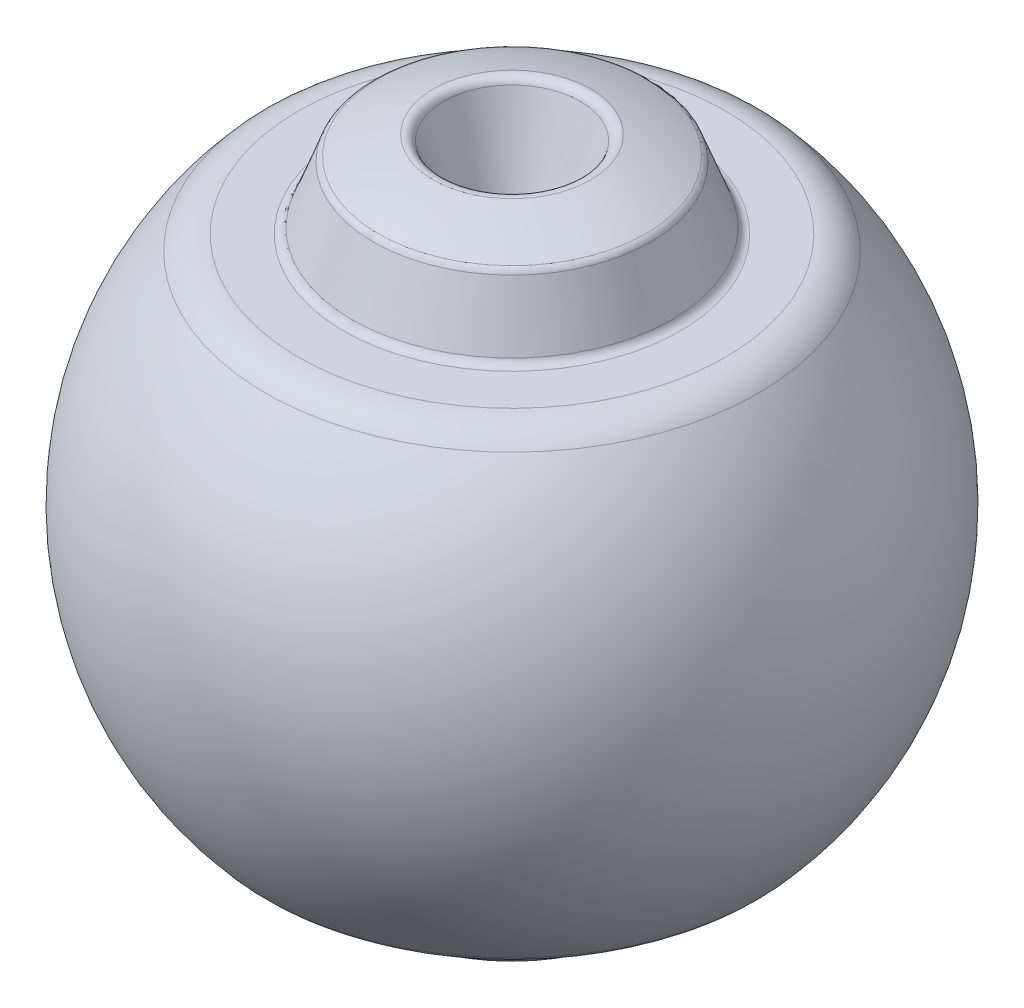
ISO-10303-21;
HEADER;
FILE_DESCRIPTION(('STEP AP214'),'2;1');
FILE_NAME('part.step','',(''),(''),'','','');
FILE_SCHEMA(('AUTOMOTIVE_DESIGN { 1 0 10303 214 1 1 1 1 }'));
ENDSEC;
DATA;
#1=APPLICATION_CONTEXT('core data for automotive mechanical design processes');
#2=APPLICATION_PROTOCOL_DEFINITION('international standard','automotive_design',2000,#1);
#3=PRODUCT_CONTEXT('',#1,'mechanical');
#4=PRODUCT('Part','Part','',(#3));
#5=PRODUCT_RELATED_PRODUCT_CATEGORY('part','',(#4));
#6=PRODUCT_DEFINITION_FORMATION('','',#4);
#7=PRODUCT_DEFINITION_CONTEXT('part definition',#1,'design');
#8=PRODUCT_DEFINITION('design','',#6,#7);
#9=PRODUCT_DEFINITION_SHAPE('','',#8);
#10=(LENGTH_UNIT() NAMED_UNIT(*) SI_UNIT(.MILLI.,.METRE.));
#11=(NAMED_UNIT(*) PLANE_ANGLE_UNIT() SI_UNIT($,.RADIAN.));
#12=(NAMED_UNIT(*) SI_UNIT($,.STERADIAN.) SOLID_ANGLE_UNIT());
#13=UNCERTAINTY_MEASURE_WITH_UNIT(LENGTH_MEASURE(1.E-05),#10,'distance_accuracy_value','');
#14=(GEOMETRIC_REPRESENTATION_CONTEXT(3) GLOBAL_UNCERTAINTY_ASSIGNED_CONTEXT((#13)) GLOBAL_UNIT_ASSIGNED_CONTEXT((#10,
#11,#12)) REPRESENTATION_CONTEXT('',''));
#15=CARTESIAN_POINT('',(0.,0.,0.));
#16=DIRECTION('',(0.,0.,1.));
#17=DIRECTION('',(1.,0.,0.));
#18=AXIS2_PLACEMENT_3D('',#15,#16,#17);
#19=CARTESIAN_POINT('',(0.,0.,0.));
#20=DIRECTION('',(0.,1.,0.));
#21=DIRECTION('',(1.,0.,0.));
#22=AXIS2_PLACEMENT_3D('',#19,#20,#21);
#23=SPHERICAL_SURFACE('',#22,37.5);
#24=CARTESIAN_POINT('',(0.,24.9165030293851,0.));
#25=DIRECTION('',(0.,-1.,0.));
#26=DIRECTION('',(1.,0.,0.));
#27=AXIS2_PLACEMENT_3D('',#24,#25,#26);
#28=CIRCLE('',#27,28.0253077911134);
#29=CARTESIAN_POINT('',(28.0253077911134,24.9165030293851,0.));
#30=VERTEX_POINT('',#29);
#31=EDGE_CURVE('E39',#30,#30,#28,.T.);
#32=CARTESIAN_POINT('',(0.,-24.9165030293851,0.));
#33=DIRECTION('',(0.,1.,0.));
#34=DIRECTION('',(-1.,0.,0.));
#35=AXIS2_PLACEMENT_3D('',#32,#33,#34);
#36=CIRCLE('',#35,28.0253077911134);
#37=CARTESIAN_POINT('',(28.0253077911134,-24.9165030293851,0.));
#38=VERTEX_POINT('',#37);
#39=EDGE_CURVE('E43',#38,#38,#36,.T.);
#40=CARTESIAN_POINT('',(28.0253077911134,24.9165030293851,0.));
#41=CARTESIAN_POINT('',(28.4025637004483,24.4921916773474,0.));
#42=CARTESIAN_POINT('',(28.7701685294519,24.0593008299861,0.));
#43=CARTESIAN_POINT('',(29.4853503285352,23.1772795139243,0.));
#44=CARTESIAN_POINT('',(29.8329272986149,22.7281490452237,0.));
#45=CARTESIAN_POINT('',(30.5073276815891,21.8145678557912,0.));
#46=CARTESIAN_POINT('',(30.8341510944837,21.3501171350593,0.));
#47=CARTESIAN_POINT('',(31.4663725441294,20.4068553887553,0.));
#48=CARTESIAN_POINT('',(31.7717705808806,19.9280443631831,0.));
#49=CARTESIAN_POINT('',(32.360510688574,18.9570491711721,0.));
#50=CARTESIAN_POINT('',(32.6438527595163,18.4648650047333,0.));
#51=CARTESIAN_POINT('',(33.1878966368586,17.4681389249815,0.));
#52=CARTESIAN_POINT('',(33.4485984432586,16.9635970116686,0.));
#53=CARTESIAN_POINT('',(33.9468239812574,15.9431961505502,0.));
#54=CARTESIAN_POINT('',(34.1843477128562,15.4273372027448,0.));
#55=CARTESIAN_POINT('',(34.6357271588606,14.3853663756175,0.));
#56=CARTESIAN_POINT('',(34.8495828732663,13.8592544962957,0.));
#57=CARTESIAN_POINT('',(35.2531851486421,12.7978630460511,0.));
#58=CARTESIAN_POINT('',(35.4429317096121,12.2625834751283,0.));
#59=CARTESIAN_POINT('',(35.797924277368,11.1839607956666,0.));
#60=CARTESIAN_POINT('',(35.9631702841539,10.6406176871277,0.));
#61=CARTESIAN_POINT('',(36.2688208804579,9.54698871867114,0.));
#62=CARTESIAN_POINT('',(36.4092254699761,8.99670285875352,0.));
#63=CARTESIAN_POINT('',(36.6649036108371,7.89032349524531,0.));
#64=CARTESIAN_POINT('',(36.7801771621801,7.33422999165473,0.));
#65=CARTESIAN_POINT('',(36.9853554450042,6.21738242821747,0.));
#66=CARTESIAN_POINT('',(37.0752601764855,5.65662836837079,0.));
#67=CARTESIAN_POINT('',(37.2295153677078,4.53161639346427,0.));
#68=CARTESIAN_POINT('',(37.2938658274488,3.96735847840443,0.));
#69=CARTESIAN_POINT('',(37.3968797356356,2.83650272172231,0.));
#70=CARTESIAN_POINT('',(37.4355431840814,2.26990488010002,0.));
#71=CARTESIAN_POINT('',(37.4871033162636,1.13553802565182,0.));
#72=CARTESIAN_POINT('',(37.5,0.567769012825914,0.));
#73=CARTESIAN_POINT('',(37.5,-0.567769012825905,0.));
#74=CARTESIAN_POINT('',(37.4871033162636,-1.13553802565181,0.));
#75=CARTESIAN_POINT('',(37.4355431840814,-2.26990488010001,0.));
#76=CARTESIAN_POINT('',(37.3968797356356,-2.8365027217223,0.));
#77=CARTESIAN_POINT('',(37.2938658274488,-3.96735847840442,0.));
#78=CARTESIAN_POINT('',(37.2295153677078,-4.53161639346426,0.));
#79=CARTESIAN_POINT('',(37.0752601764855,-5.65662836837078,0.));
#80=CARTESIAN_POINT('',(36.9853554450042,-6.21738242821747,0.));
#81=CARTESIAN_POINT('',(36.7801771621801,-7.33422999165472,0.));
#82=CARTESIAN_POINT('',(36.6649036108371,-7.8903234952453,0.));
#83=CARTESIAN_POINT('',(36.4092254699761,-8.99670285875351,0.));
#84=CARTESIAN_POINT('',(36.2688208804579,-9.54698871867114,0.));
#85=CARTESIAN_POINT('',(35.9631702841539,-10.6406176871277,0.));
#86=CARTESIAN_POINT('',(35.797924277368,-11.1839607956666,0.));
#87=CARTESIAN_POINT('',(35.4429317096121,-12.2625834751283,0.));
#88=CARTESIAN_POINT('',(35.2531851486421,-12.7978630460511,0.));
#89=CARTESIAN_POINT('',(34.8495828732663,-13.8592544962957,0.));
#90=CARTESIAN_POINT('',(34.6357271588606,-14.3853663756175,0.));
#91=CARTESIAN_POINT('',(34.1843477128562,-15.4273372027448,0.));
#92=CARTESIAN_POINT('',(33.9468239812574,-15.9431961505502,0.));
#93=CARTESIAN_POINT('',(33.4485984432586,-16.9635970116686,0.));
#94=CARTESIAN_POINT('',(33.1878966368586,-17.4681389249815,0.));
#95=CARTESIAN_POINT('',(32.6438527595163,-18.4648650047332,0.));
#96=CARTESIAN_POINT('',(32.3605106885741,-18.9570491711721,0.));
#97=CARTESIAN_POINT('',(31.7717705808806,-19.9280443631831,0.));
#98=CARTESIAN_POINT('',(31.4663725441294,-20.4068553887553,0.));
#99=CARTESIAN_POINT('',(30.8341510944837,-21.3501171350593,0.));
#100=CARTESIAN_POINT('',(30.5073276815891,-21.8145678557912,0.));
#101=CARTESIAN_POINT('',(29.8329272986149,-22.7281490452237,0.));
#102=CARTESIAN_POINT('',(29.4853503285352,-23.1772795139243,0.));
#103=CARTESIAN_POINT('',(28.7701685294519,-24.0593008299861,0.));
#104=CARTESIAN_POINT('',(28.4025637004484,-24.4921916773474,0.));
#105=CARTESIAN_POINT('',(28.0253077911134,-24.9165030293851,0.));
#106=B_SPLINE_CURVE_WITH_KNOTS('',3,(#40,#41,#42,#43,#44,#45,#46,#47,#48,#49,#50,#51,#52,#53,
#54,#55,#56,#57,#58,#59,#60,#61,#62,#63,#64,#65,#66,#67,#68,#69,#70,#71,#72,#73,#74,#75,#76,#77,
#78,#79,#80,#81,#82,#83,#84,#85,#86,#87,#88,#89,#90,#91,#92,#93,#94,#95,#96,#97,#98,#99,#100,
#101,#102,#103,#104,#105),.UNSPECIFIED.,.F.,.F.,(4,2,2,2,2,2,2,2,2,2,2,2,2,2,2,2,2,2,2,2,2,2,2,
2,2,2,2,2,2,2,2,2,4),(0.,1.7031606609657,3.40632132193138,5.10948198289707,6.81264264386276,
8.51580330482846,10.2189639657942,11.9221246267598,13.6252852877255,15.3284459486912,
17.0316066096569,18.7347672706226,20.4379279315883,22.141088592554,23.8442492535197,
25.5474099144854,27.2505705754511,28.9537312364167,30.6568918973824,32.3600525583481,
34.0632132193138,35.7663738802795,37.4695345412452,39.1726952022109,40.8758558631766,
42.5790165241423,44.2821771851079,45.9853378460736,47.6884985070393,49.391659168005,
51.0948198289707,52.7979804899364,54.5011411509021),.UNSPECIFIED.);
#107=EDGE_CURVE('BSEAM32',#30,#38,#106,.T.);
#108=ORIENTED_EDGE('',*,*,#31,.T.);
#109=ORIENTED_EDGE('',*,*,#39,.T.);
#110=ORIENTED_EDGE('',*,*,#107,.T.);
#111=ORIENTED_EDGE('',*,*,#107,.F.);
#112=EDGE_LOOP('',(#108,#110,#109,#111));
#113=FACE_BOUND('',#112,.T.);
#114=ADVANCED_FACE('F32',(#113),#23,.T.);
#115=CARTESIAN_POINT('',(0.,26.5943026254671,0.));
#116=DIRECTION('',(0.,1.,0.));
#117=DIRECTION('',(-1.,0.,0.));
#118=AXIS2_PLACEMENT_3D('',#115,#116,#117);
#119=PLANE('',#118);
#120=CARTESIAN_POINT('',(0.,26.5943026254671,0.));
#121=DIRECTION('',(0.,1.,0.));
#122=DIRECTION('',(-1.,0.,0.));
#123=AXIS2_PLACEMENT_3D('',#120,#121,#122);
#124=CIRCLE('',#123,24.2886000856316);
#125=CARTESIAN_POINT('',(-24.2886000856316,26.5943026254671,0.));
#126=VERTEX_POINT('',#125);
#127=EDGE_CURVE('E47',#126,#126,#124,.T.);
#128=ORIENTED_EDGE('',*,*,#127,.T.);
#129=EDGE_LOOP('',(#128));
#130=FACE_BOUND('',#129,.T.);
#131=CARTESIAN_POINT('',(0.,26.5943026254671,0.));
#132=DIRECTION('',(0.,1.,0.));
#133=DIRECTION('',(-1.,0.,0.));
#134=AXIS2_PLACEMENT_3D('',#131,#132,#133);
#135=CIRCLE('',#134,19.1318013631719);
#136=CARTESIAN_POINT('',(-19.1318013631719,26.5943026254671,0.));
#137=VERTEX_POINT('',#136);
#138=EDGE_CURVE('E85',#137,#137,#135,.F.);
#139=ORIENTED_EDGE('',*,*,#138,.T.);
#140=EDGE_LOOP('',(#139));
#141=FACE_BOUND('',#140,.T.);
#142=ADVANCED_FACE('F134',(#130,#141),#119,.T.);
#143=CARTESIAN_POINT('',(0.,34.0861642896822,0.));
#144=DIRECTION('',(0.,-1.,0.));
#145=DIRECTION('',(1.,0.,0.));
#146=AXIS2_PLACEMENT_3D('',#143,#144,#145);
#147=CONICAL_SURFACE('',#146,15.632766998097,0.358333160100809);
#148=CARTESIAN_POINT('',(0.,33.6968099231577,0.));
#149=DIRECTION('',(0.,1.,0.));
#150=DIRECTION('',(-1.,0.,0.));
#151=AXIS2_PLACEMENT_3D('',#148,#149,#150);
#152=CIRCLE('',#151,15.7785806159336);
#153=CARTESIAN_POINT('',(-15.7785806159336,33.6968099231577,0.));
#154=VERTEX_POINT('',#153);
#155=EDGE_CURVE('E88',#154,#154,#152,.F.);
#156=ORIENTED_EDGE('',*,*,#155,.T.);
#157=EDGE_LOOP('',(#156));
#158=FACE_BOUND('',#157,.T.);
#159=CARTESIAN_POINT('',(0.,27.2435888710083,0.));
#160=DIRECTION('',(0.,-1.,0.));
#161=DIRECTION('',(1.,0.,0.));
#162=AXIS2_PLACEMENT_3D('',#159,#160,#161);
#163=CIRCLE('',#162,18.195318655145);
#164=CARTESIAN_POINT('',(18.195318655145,27.2435888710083,0.));
#165=VERTEX_POINT('',#164);
#166=EDGE_CURVE('E91',#165,#165,#163,.F.);
#167=ORIENTED_EDGE('',*,*,#166,.T.);
#168=EDGE_LOOP('',(#167));
#169=FACE_BOUND('',#168,.T.);
#170=ADVANCED_FACE('F139',(#158,#169),#147,.T.);
#171=CARTESIAN_POINT('',(0.,0.,0.));
#172=DIRECTION('',(0.,1.,0.));
#173=DIRECTION('',(1.,0.,0.));
#174=AXIS2_PLACEMENT_3D('',#171,#172,#173);
#175=SPHERICAL_SURFACE('',#174,37.5);
#176=CARTESIAN_POINT('',(0.,34.2596878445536,0.));
#177=DIRECTION('',(0.,-1.,0.));
#178=DIRECTION('',(1.,0.,0.));
#179=AXIS2_PLACEMENT_3D('',#176,#177,#178);
#180=CIRCLE('',#179,15.2487307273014);
#181=CARTESIAN_POINT('',(15.2487307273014,34.2596878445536,0.));
#182=VERTEX_POINT('',#181);
#183=EDGE_CURVE('E94',#182,#182,#180,.F.);
#184=CARTESIAN_POINT('',(0.,36.4138074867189,0.));
#185=DIRECTION('',(0.,-1.,0.));
#186=DIRECTION('',(1.,0.,0.));
#187=AXIS2_PLACEMENT_3D('',#184,#185,#186);
#188=CIRCLE('',#187,8.96016876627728);
#189=CARTESIAN_POINT('',(8.96016876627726,36.413807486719,0.));
#190=VERTEX_POINT('',#189);
#191=EDGE_CURVE('E97',#190,#190,#188,.T.);
#192=CARTESIAN_POINT('',(15.2487307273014,34.2596878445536,0.));
#193=CARTESIAN_POINT('',(15.1853883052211,34.2878810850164,0.));
#194=CARTESIAN_POINT('',(15.1219676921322,34.3158986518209,0.));
#195=CARTESIAN_POINT('',(14.994972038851,34.3715815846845,0.));
#196=CARTESIAN_POINT('',(14.9313969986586,34.3992469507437,0.));
#197=CARTESIAN_POINT('',(14.804094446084,34.4542246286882,0.));
#198=CARTESIAN_POINT('',(14.7403669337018,34.4815369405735,0.));
#199=CARTESIAN_POINT('',(14.6127613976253,34.5358076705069,0.));
#200=CARTESIAN_POINT('',(14.548883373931,34.5627660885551,0.));
#201=CARTESIAN_POINT('',(14.4209787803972,34.6163282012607,0.));
#202=CARTESIAN_POINT('',(14.3569522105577,34.6429318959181,0.));
#203=CARTESIAN_POINT('',(14.2287524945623,34.6957837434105,0.));
#204=CARTESIAN_POINT('',(14.1645793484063,34.7220318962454,0.));
#205=CARTESIAN_POINT('',(14.0360884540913,34.7741718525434,0.));
#206=CARTESIAN_POINT('',(13.9717707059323,34.8000636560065,0.));
#207=CARTESIAN_POINT('',(13.8429925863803,34.8514901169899,0.));
#208=CARTESIAN_POINT('',(13.7785322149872,34.8770247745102,0.));
#209=CARTESIAN_POINT('',(13.6494708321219,34.9277361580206,0.));
#210=CARTESIAN_POINT('',(13.5848698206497,34.9529128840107,0.));
#211=CARTESIAN_POINT('',(13.4555291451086,35.0029076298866,0.));
#212=CARTESIAN_POINT('',(13.3907894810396,35.0277256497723,0.));
#213=CARTESIAN_POINT('',(13.2611734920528,35.0770022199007,0.));
#214=CARTESIAN_POINT('',(13.196297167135,35.1014607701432,0.));
#215=CARTESIAN_POINT('',(13.0664098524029,35.1500176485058,0.));
#216=CARTESIAN_POINT('',(13.0013988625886,35.1741159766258,0.));
#217=CARTESIAN_POINT('',(12.871244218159,35.2219516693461,0.));
#218=CARTESIAN_POINT('',(12.8061005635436,35.2456890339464,0.));
#219=CARTESIAN_POINT('',(12.6756825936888,35.2928020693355,0.));
#220=CARTESIAN_POINT('',(12.6104082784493,35.3161777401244,0.));
#221=CARTESIAN_POINT('',(12.479730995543,35.3625666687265,0.));
#222=CARTESIAN_POINT('',(12.4143280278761,35.3855799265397,0.));
#223=CARTESIAN_POINT('',(12.2833954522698,35.4312433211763,0.));
#224=CARTESIAN_POINT('',(12.2178658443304,35.4538934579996,0.));
#225=CARTESIAN_POINT('',(12.0866820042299,35.4988299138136,0.));
#226=CARTESIAN_POINT('',(12.0210277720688,35.5211162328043,0.));
#227=CARTESIAN_POINT('',(11.8895967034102,35.5653243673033,0.));
#228=CARTESIAN_POINT('',(11.8238198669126,35.5872461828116,0.));
#229=CARTESIAN_POINT('',(11.692145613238,35.6307246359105,0.));
#230=CARTESIAN_POINT('',(11.626248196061,35.652281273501,0.));
#231=CARTESIAN_POINT('',(11.4943348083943,35.6950287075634,0.));
#232=CARTESIAN_POINT('',(11.4283188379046,35.7162195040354,0.));
#233=CARTESIAN_POINT('',(11.2961703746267,35.7582346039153,0.));
#234=CARTESIAN_POINT('',(11.2300378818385,35.7790589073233,0.));
#235=CARTESIAN_POINT('',(11.0976584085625,35.8203403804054,0.));
#236=CARTESIAN_POINT('',(11.0314114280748,35.8407975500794,0.));
#237=CARTESIAN_POINT('',(10.8988050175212,35.8813441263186,0.));
#238=CARTESIAN_POINT('',(10.8324455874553,35.9014335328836,0.));
#239=CARTESIAN_POINT('',(10.6996163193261,35.9412439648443,0.));
#240=CARTESIAN_POINT('',(10.6331464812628,35.9609649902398,0.));
#241=CARTESIAN_POINT('',(10.5000984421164,36.0000380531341,0.));
#242=CARTESIAN_POINT('',(10.4335202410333,36.0193900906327,0.));
#243=CARTESIAN_POINT('',(10.300257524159,36.0577245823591,0.));
#244=CARTESIAN_POINT('',(10.2335730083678,36.0767070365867,0.));
#245=CARTESIAN_POINT('',(10.1000997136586,36.114301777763,0.));
#246=CARTESIAN_POINT('',(10.0333109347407,36.1329140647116,0.));
#247=CARTESIAN_POINT('',(9.89963116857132,36.169767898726,0.));
#248=CARTESIAN_POINT('',(9.83274018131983,36.1880094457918,0.));
#249=CARTESIAN_POINT('',(9.69885805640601,36.2241212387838,0.));
#250=CARTESIAN_POINT('',(9.63186691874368,36.2419914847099,0.));
#251=CARTESIAN_POINT('',(9.49778655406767,36.2773601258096,0.));
#252=CARTESIAN_POINT('',(9.43069732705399,36.2948585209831,0.));
#253=CARTESIAN_POINT('',(9.29642284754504,36.329482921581,0.));
#254=CARTESIAN_POINT('',(9.22923759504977,36.3466089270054,0.));
#255=CARTESIAN_POINT('',(9.09477313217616,36.3804880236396,0.));
#256=CARTESIAN_POINT('',(9.02749392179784,36.3972411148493,0.));
#257=CARTESIAN_POINT('',(8.96016876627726,36.413807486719,0.));
#258=B_SPLINE_CURVE_WITH_KNOTS('',3,(#192,#193,#194,#195,#196,#197,#198,#199,#200,#201,#202,
#203,#204,#205,#206,#207,#208,#209,#210,#211,#212,#213,#214,#215,#216,#217,#218,#219,#220,#221,
#222,#223,#224,#225,#226,#227,#228,#229,#230,#231,#232,#233,#234,#235,#236,#237,#238,#239,#240,
#241,#242,#243,#244,#245,#246,#247,#248,#249,#250,#251,#252,#253,#254,#255,#256,#257),
.UNSPECIFIED.,.F.,.F.,(4,2,2,2,2,2,2,2,2,2,2,2,2,2,2,2,2,2,2,2,2,2,2,2,2,2,2,2,2,2,2,2,4),(0.,
0.20799995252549,0.415999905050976,0.623999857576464,0.831999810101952,1.03999976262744,
1.24799971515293,1.45599966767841,1.66399962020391,1.8719995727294,2.07999952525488,
2.28799947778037,2.49599943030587,2.70399938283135,2.91199933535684,3.11999928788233,
3.32799924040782,3.53599919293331,3.74399914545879,3.95199909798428,4.15999905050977,
4.36799900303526,4.57599895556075,4.78399890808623,4.99199886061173,5.19999881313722,
5.4079987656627,5.61599871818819,5.82399867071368,6.03199862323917,6.23999857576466,
6.44799852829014,6.65599848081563),.UNSPECIFIED.);
#259=EDGE_CURVE('BSEAM101',#182,#190,#258,.T.);
#260=ORIENTED_EDGE('',*,*,#183,.T.);
#261=ORIENTED_EDGE('',*,*,#191,.T.);
#262=ORIENTED_EDGE('',*,*,#259,.T.);
#263=ORIENTED_EDGE('',*,*,#259,.F.);
#264=EDGE_LOOP('',(#260,#262,#261,#263));
#265=FACE_BOUND('',#264,.T.);
#266=ADVANCED_FACE('F101',(#265),#175,.T.);
#267=CARTESIAN_POINT('',(0.,36.6181019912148,0.));
#268=DIRECTION('',(0.,1.,0.));
#269=DIRECTION('',(-1.,0.,0.));
#270=AXIS2_PLACEMENT_3D('',#267,#268,#269);
#271=CONICAL_SURFACE('',#270,8.08483806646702,0.349065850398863);
#272=CARTESIAN_POINT('',(0.,35.7847927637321,0.));
#273=DIRECTION('',(0.,1.,0.));
#274=DIRECTION('',(-1.,0.,0.));
#275=AXIS2_PLACEMENT_3D('',#272,#273,#274);
#276=CIRCLE('',#275,7.78153831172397);
#277=CARTESIAN_POINT('',(-7.78153831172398,35.7847927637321,0.));
#278=VERTEX_POINT('',#277);
#279=EDGE_CURVE('E79',#278,#278,#276,.T.);
#280=ORIENTED_EDGE('',*,*,#279,.T.);
#281=EDGE_LOOP('',(#280));
#282=FACE_BOUND('',#281,.T.);
#283=CARTESIAN_POINT('',(0.,27.2522824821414,0.));
#284=DIRECTION('',(0.,1.,0.));
#285=DIRECTION('',(-1.,0.,0.));
#286=AXIS2_PLACEMENT_3D('',#283,#284,#285);
#287=CIRCLE('',#286,4.67595854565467);
#288=CARTESIAN_POINT('',(-4.67595854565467,27.2522824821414,0.));
#289=VERTEX_POINT('',#288);
#290=EDGE_CURVE('E82',#289,#289,#287,.F.);
#291=ORIENTED_EDGE('',*,*,#290,.T.);
#292=EDGE_LOOP('',(#291));
#293=FACE_BOUND('',#292,.T.);
#294=ADVANCED_FACE('F111',(#282,#293),#271,.F.);
#295=CARTESIAN_POINT('',(0.,26.5943026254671,0.));
#296=DIRECTION('',(0.,-1.,0.));
#297=DIRECTION('',(1.,0.,0.));
#298=AXIS2_PLACEMENT_3D('',#295,#296,#297);
#299=PLANE('',#298);
#300=CARTESIAN_POINT('',(0.,26.5943026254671,0.));
#301=DIRECTION('',(0.,-1.,0.));
#302=DIRECTION('',(1.,0.,0.));
#303=AXIS2_PLACEMENT_3D('',#300,#301,#302);
#304=CIRCLE('',#303,3.73626592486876);
#305=CARTESIAN_POINT('',(3.73626592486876,26.5943026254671,0.));
#306=VERTEX_POINT('',#305);
#307=EDGE_CURVE('E76',#306,#306,#304,.F.);
#308=ORIENTED_EDGE('',*,*,#307,.T.);
#309=EDGE_LOOP('',(#308));
#310=FACE_BOUND('',#309,.T.);
#311=ADVANCED_FACE('F114',(#310),#299,.F.);
#312=CARTESIAN_POINT('',(0.,-26.5943026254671,0.));
#313=DIRECTION('',(0.,-1.,0.));
#314=DIRECTION('',(1.,0.,0.));
#315=AXIS2_PLACEMENT_3D('',#312,#313,#314);
#316=PLANE('',#315);
#317=CARTESIAN_POINT('',(0.,-26.5943026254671,0.));
#318=DIRECTION('',(0.,-1.,0.));
#319=DIRECTION('',(1.,0.,0.));
#320=AXIS2_PLACEMENT_3D('',#317,#318,#319);
#321=CIRCLE('',#320,3.73626592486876);
#322=CARTESIAN_POINT('',(3.73626592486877,-26.5943026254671,0.));
#323=VERTEX_POINT('',#322);
#324=EDGE_CURVE('E52',#323,#323,#321,.T.);
#325=ORIENTED_EDGE('',*,*,#324,.T.);
#326=EDGE_LOOP('',(#325));
#327=FACE_BOUND('',#326,.T.);
#328=ADVANCED_FACE('F125',(#327),#316,.T.);
#329=CARTESIAN_POINT('',(0.,-36.6181019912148,0.));
#330=DIRECTION('',(0.,-1.,0.));
#331=DIRECTION('',(1.,0.,0.));
#332=AXIS2_PLACEMENT_3D('',#329,#330,#331);
#333=CONICAL_SURFACE('',#332,8.08483806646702,0.349065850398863);
#334=CARTESIAN_POINT('',(0.,-35.7847927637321,0.));
#335=DIRECTION('',(0.,1.,0.));
#336=DIRECTION('',(-1.,0.,0.));
#337=AXIS2_PLACEMENT_3D('',#334,#335,#336);
#338=CIRCLE('',#337,7.78153831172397);
#339=CARTESIAN_POINT('',(-7.78153831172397,-35.7847927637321,0.));
#340=VERTEX_POINT('',#339);
#341=EDGE_CURVE('E55',#340,#340,#338,.F.);
#342=ORIENTED_EDGE('',*,*,#341,.T.);
#343=EDGE_LOOP('',(#342));
#344=FACE_BOUND('',#343,.T.);
#345=CARTESIAN_POINT('',(0.,-27.2522824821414,0.));
#346=DIRECTION('',(0.,-1.,0.));
#347=DIRECTION('',(1.,0.,0.));
#348=AXIS2_PLACEMENT_3D('',#345,#346,#347);
#349=CIRCLE('',#348,4.67595854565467);
#350=CARTESIAN_POINT('',(4.67595854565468,-27.2522824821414,0.));
#351=VERTEX_POINT('',#350);
#352=EDGE_CURVE('E58',#351,#351,#349,.F.);
#353=ORIENTED_EDGE('',*,*,#352,.T.);
#354=EDGE_LOOP('',(#353));
#355=FACE_BOUND('',#354,.T.);
#356=ADVANCED_FACE('F130',(#344,#355),#333,.F.);
#357=CARTESIAN_POINT('',(0.,0.,0.));
#358=DIRECTION('',(0.,1.,0.));
#359=DIRECTION('',(1.,0.,0.));
#360=AXIS2_PLACEMENT_3D('',#357,#358,#359);
#361=SPHERICAL_SURFACE('',#360,37.5);
#362=CARTESIAN_POINT('',(0.,-34.2596878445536,0.));
#363=DIRECTION('',(0.,1.,0.));
#364=DIRECTION('',(-1.,0.,0.));
#365=AXIS2_PLACEMENT_3D('',#362,#363,#364);
#366=CIRCLE('',#365,15.2487307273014);
#367=CARTESIAN_POINT('',(15.2487307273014,-34.2596878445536,0.));
#368=VERTEX_POINT('',#367);
#369=EDGE_CURVE('E64',#368,#368,#366,.F.);
#370=CARTESIAN_POINT('',(0.,-36.413807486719,0.));
#371=DIRECTION('',(0.,1.,0.));
#372=DIRECTION('',(-1.,0.,0.));
#373=AXIS2_PLACEMENT_3D('',#370,#371,#372);
#374=CIRCLE('',#373,8.96016876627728);
#375=CARTESIAN_POINT('',(8.96016876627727,-36.413807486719,0.));
#376=VERTEX_POINT('',#375);
#377=EDGE_CURVE('E67',#376,#376,#374,.T.);
#378=CARTESIAN_POINT('',(15.2487307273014,-34.2596878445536,0.));
#379=CARTESIAN_POINT('',(15.1853883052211,-34.2878810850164,0.));
#380=CARTESIAN_POINT('',(15.1219676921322,-34.3158986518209,0.));
#381=CARTESIAN_POINT('',(14.994972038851,-34.3715815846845,0.));
#382=CARTESIAN_POINT('',(14.9313969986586,-34.3992469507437,0.));
#383=CARTESIAN_POINT('',(14.804094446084,-34.4542246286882,0.));
#384=CARTESIAN_POINT('',(14.7403669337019,-34.4815369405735,0.));
#385=CARTESIAN_POINT('',(14.6127613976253,-34.535807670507,0.));
#386=CARTESIAN_POINT('',(14.548883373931,-34.5627660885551,0.));
#387=CARTESIAN_POINT('',(14.4209787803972,-34.6163282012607,0.));
#388=CARTESIAN_POINT('',(14.3569522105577,-34.6429318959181,0.));
#389=CARTESIAN_POINT('',(14.2287524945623,-34.6957837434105,0.));
#390=CARTESIAN_POINT('',(14.1645793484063,-34.7220318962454,0.));
#391=CARTESIAN_POINT('',(14.0360884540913,-34.7741718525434,0.));
#392=CARTESIAN_POINT('',(13.9717707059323,-34.8000636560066,0.));
#393=CARTESIAN_POINT('',(13.8429925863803,-34.8514901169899,0.));
#394=CARTESIAN_POINT('',(13.7785322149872,-34.8770247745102,0.));
#395=CARTESIAN_POINT('',(13.6494708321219,-34.9277361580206,0.));
#396=CARTESIAN_POINT('',(13.5848698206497,-34.9529128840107,0.));
#397=CARTESIAN_POINT('',(13.4555291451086,-35.0029076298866,0.));
#398=CARTESIAN_POINT('',(13.3907894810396,-35.0277256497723,0.));
#399=CARTESIAN_POINT('',(13.2611734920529,-35.0770022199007,0.));
#400=CARTESIAN_POINT('',(13.196297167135,-35.1014607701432,0.));
#401=CARTESIAN_POINT('',(13.0664098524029,-35.1500176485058,0.));
#402=CARTESIAN_POINT('',(13.0013988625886,-35.1741159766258,0.));
#403=CARTESIAN_POINT('',(12.871244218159,-35.2219516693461,0.));
#404=CARTESIAN_POINT('',(12.8061005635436,-35.2456890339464,0.));
#405=CARTESIAN_POINT('',(12.6756825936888,-35.2928020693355,0.));
#406=CARTESIAN_POINT('',(12.6104082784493,-35.3161777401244,0.));
#407=CARTESIAN_POINT('',(12.479730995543,-35.3625666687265,0.));
#408=CARTESIAN_POINT('',(12.4143280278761,-35.3855799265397,0.));
#409=CARTESIAN_POINT('',(12.2833954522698,-35.4312433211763,0.));
#410=CARTESIAN_POINT('',(12.2178658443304,-35.4538934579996,0.));
#411=CARTESIAN_POINT('',(12.0866820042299,-35.4988299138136,0.));
#412=CARTESIAN_POINT('',(12.0210277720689,-35.5211162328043,0.));
#413=CARTESIAN_POINT('',(11.8895967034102,-35.5653243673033,0.));
#414=CARTESIAN_POINT('',(11.8238198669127,-35.5872461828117,0.));
#415=CARTESIAN_POINT('',(11.692145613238,-35.6307246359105,0.));
#416=CARTESIAN_POINT('',(11.626248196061,-35.652281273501,0.));
#417=CARTESIAN_POINT('',(11.4943348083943,-35.6950287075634,0.));
#418=CARTESIAN_POINT('',(11.4283188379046,-35.7162195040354,0.));
#419=CARTESIAN_POINT('',(11.2961703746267,-35.7582346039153,0.));
#420=CARTESIAN_POINT('',(11.2300378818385,-35.7790589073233,0.));
#421=CARTESIAN_POINT('',(11.0976584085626,-35.8203403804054,0.));
#422=CARTESIAN_POINT('',(11.0314114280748,-35.8407975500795,0.));
#423=CARTESIAN_POINT('',(10.8988050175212,-35.8813441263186,0.));
#424=CARTESIAN_POINT('',(10.8324455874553,-35.9014335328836,0.));
#425=CARTESIAN_POINT('',(10.6996163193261,-35.9412439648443,0.));
#426=CARTESIAN_POINT('',(10.6331464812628,-35.9609649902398,0.));
#427=CARTESIAN_POINT('',(10.5000984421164,-36.0000380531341,0.));
#428=CARTESIAN_POINT('',(10.4335202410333,-36.0193900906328,0.));
#429=CARTESIAN_POINT('',(10.300257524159,-36.0577245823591,0.));
#430=CARTESIAN_POINT('',(10.2335730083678,-36.0767070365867,0.));
#431=CARTESIAN_POINT('',(10.1000997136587,-36.114301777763,0.));
#432=CARTESIAN_POINT('',(10.0333109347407,-36.1329140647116,0.));
#433=CARTESIAN_POINT('',(9.89963116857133,-36.169767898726,0.));
#434=CARTESIAN_POINT('',(9.83274018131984,-36.1880094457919,0.));
#435=CARTESIAN_POINT('',(9.69885805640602,-36.2241212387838,0.));
#436=CARTESIAN_POINT('',(9.63186691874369,-36.2419914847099,0.));
#437=CARTESIAN_POINT('',(9.49778655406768,-36.2773601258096,0.));
#438=CARTESIAN_POINT('',(9.430697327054,-36.2948585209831,0.));
#439=CARTESIAN_POINT('',(9.29642284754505,-36.329482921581,0.));
#440=CARTESIAN_POINT('',(9.22923759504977,-36.3466089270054,0.));
#441=CARTESIAN_POINT('',(9.09477313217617,-36.3804880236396,0.));
#442=CARTESIAN_POINT('',(9.02749392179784,-36.3972411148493,0.));
#443=CARTESIAN_POINT('',(8.96016876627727,-36.413807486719,0.));
#444=B_SPLINE_CURVE_WITH_KNOTS('',3,(#378,#379,#380,#381,#382,#383,#384,#385,#386,#387,#388,
#389,#390,#391,#392,#393,#394,#395,#396,#397,#398,#399,#400,#401,#402,#403,#404,#405,#406,#407,
#408,#409,#410,#411,#412,#413,#414,#415,#416,#417,#418,#419,#420,#421,#422,#423,#424,#425,#426,
#427,#428,#429,#430,#431,#432,#433,#434,#435,#436,#437,#438,#439,#440,#441,#442,#443),
.UNSPECIFIED.,.F.,.F.,(4,2,2,2,2,2,2,2,2,2,2,2,2,2,2,2,2,2,2,2,2,2,2,2,2,2,2,2,2,2,2,2,4),(0.,
0.20799995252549,0.415999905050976,0.623999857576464,0.83199981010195,1.03999976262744,
1.24799971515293,1.45599966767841,1.66399962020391,1.8719995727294,2.07999952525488,
2.28799947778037,2.49599943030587,2.70399938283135,2.91199933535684,3.11999928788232,
3.32799924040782,3.53599919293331,3.74399914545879,3.95199909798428,4.15999905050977,
4.36799900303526,4.57599895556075,4.78399890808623,4.99199886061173,5.19999881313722,
5.4079987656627,5.61599871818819,5.82399867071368,6.03199862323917,6.23999857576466,
6.44799852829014,6.65599848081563),.UNSPECIFIED.);
#445=EDGE_CURVE('BSEAM216',#368,#376,#444,.T.);
#446=ORIENTED_EDGE('',*,*,#369,.T.);
#447=ORIENTED_EDGE('',*,*,#377,.T.);
#448=ORIENTED_EDGE('',*,*,#445,.T.);
#449=ORIENTED_EDGE('',*,*,#445,.F.);
#450=EDGE_LOOP('',(#446,#448,#447,#449));
#451=FACE_BOUND('',#450,.T.);
#452=ADVANCED_FACE('F216',(#451),#361,.T.);
#453=CARTESIAN_POINT('',(0.,-34.0861642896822,0.));
#454=DIRECTION('',(0.,1.,0.));
#455=DIRECTION('',(-1.,0.,0.));
#456=AXIS2_PLACEMENT_3D('',#453,#454,#455);
#457=CONICAL_SURFACE('',#456,15.632766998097,0.358333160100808);
#458=CARTESIAN_POINT('',(0.,-33.6968099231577,0.));
#459=DIRECTION('',(0.,1.,0.));
#460=DIRECTION('',(-1.,0.,0.));
#461=AXIS2_PLACEMENT_3D('',#458,#459,#460);
#462=CIRCLE('',#461,15.7785806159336);
#463=CARTESIAN_POINT('',(-15.7785806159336,-33.6968099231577,0.));
#464=VERTEX_POINT('',#463);
#465=EDGE_CURVE('E70',#464,#464,#462,.T.);
#466=ORIENTED_EDGE('',*,*,#465,.T.);
#467=EDGE_LOOP('',(#466));
#468=FACE_BOUND('',#467,.T.);
#469=CARTESIAN_POINT('',(0.,-27.2435888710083,0.));
#470=DIRECTION('',(0.,1.,0.));
#471=DIRECTION('',(-1.,0.,0.));
#472=AXIS2_PLACEMENT_3D('',#469,#470,#471);
#473=CIRCLE('',#472,18.195318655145);
#474=CARTESIAN_POINT('',(-18.1953186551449,-27.2435888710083,0.));
#475=VERTEX_POINT('',#474);
#476=EDGE_CURVE('E73',#475,#475,#473,.F.);
#477=ORIENTED_EDGE('',*,*,#476,.T.);
#478=EDGE_LOOP('',(#477));
#479=FACE_BOUND('',#478,.T.);
#480=ADVANCED_FACE('F226',(#468,#479),#457,.T.);
#481=CARTESIAN_POINT('',(0.,-26.5943026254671,0.));
#482=DIRECTION('',(0.,1.,0.));
#483=DIRECTION('',(-1.,0.,0.));
#484=AXIS2_PLACEMENT_3D('',#481,#482,#483);
#485=PLANE('',#484);
#486=CARTESIAN_POINT('',(0.,-26.5943026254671,0.));
#487=DIRECTION('',(0.,1.,0.));
#488=DIRECTION('',(-1.,0.,0.));
#489=AXIS2_PLACEMENT_3D('',#486,#487,#488);
#490=CIRCLE('',#489,24.2886000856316);
#491=CARTESIAN_POINT('',(-24.2886000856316,-26.5943026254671,0.));
#492=VERTEX_POINT('',#491);
#493=EDGE_CURVE('E10',#492,#492,#490,.F.);
#494=ORIENTED_EDGE('',*,*,#493,.T.);
#495=EDGE_LOOP('',(#494));
#496=FACE_BOUND('',#495,.T.);
#497=CARTESIAN_POINT('',(0.,-26.5943026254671,0.));
#498=DIRECTION('',(0.,1.,0.));
#499=DIRECTION('',(-1.,0.,0.));
#500=AXIS2_PLACEMENT_3D('',#497,#498,#499);
#501=CIRCLE('',#500,19.1318013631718);
#502=CARTESIAN_POINT('',(-19.1318013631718,-26.5943026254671,0.));
#503=VERTEX_POINT('',#502);
#504=EDGE_CURVE('E61',#503,#503,#501,.T.);
#505=ORIENTED_EDGE('',*,*,#504,.T.);
#506=EDGE_LOOP('',(#505));
#507=FACE_BOUND('',#506,.T.);
#508=ADVANCED_FACE('F148',(#496,#507),#485,.F.);
#509=CARTESIAN_POINT('',(0.,33.3460961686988,0.));
#510=DIRECTION('',(0.,-1.,0.));
#511=DIRECTION('',(1.,0.,0.));
#512=AXIS2_PLACEMENT_3D('',#509,#510,#511);
#513=TOROIDAL_SURFACE('',#512,14.8420979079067,1.);
#514=ORIENTED_EDGE('',*,*,#155,.F.);
#515=EDGE_LOOP('',(#514));
#516=FACE_BOUND('',#515,.T.);
#517=ORIENTED_EDGE('',*,*,#183,.F.);
#518=EDGE_LOOP('',(#517));
#519=FACE_BOUND('',#518,.T.);
#520=ADVANCED_FACE('F145',(#516,#519),#513,.T.);
#521=CARTESIAN_POINT('',(0.,27.5943026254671,0.));
#522=DIRECTION('',(0.,1.,0.));
#523=DIRECTION('',(-1.,0.,0.));
#524=AXIS2_PLACEMENT_3D('',#521,#522,#523);
#525=TOROIDAL_SURFACE('',#524,19.1318013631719,1.);
#526=ORIENTED_EDGE('',*,*,#138,.F.);
#527=EDGE_LOOP('',(#526));
#528=FACE_BOUND('',#527,.T.);
#529=ORIENTED_EDGE('',*,*,#166,.F.);
#530=EDGE_LOOP('',(#529));
#531=FACE_BOUND('',#530,.T.);
#532=ADVANCED_FACE('F107',(#528,#531),#525,.F.);
#533=CARTESIAN_POINT('',(0.,35.4427726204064,0.));
#534=DIRECTION('',(0.,-1.,0.));
#535=DIRECTION('',(1.,0.,0.));
#536=AXIS2_PLACEMENT_3D('',#533,#534,#535);
#537=TOROIDAL_SURFACE('',#536,8.72123093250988,1.);
#538=ORIENTED_EDGE('',*,*,#191,.F.);
#539=EDGE_LOOP('',(#538));
#540=FACE_BOUND('',#539,.T.);
#541=ORIENTED_EDGE('',*,*,#279,.F.);
#542=EDGE_LOOP('',(#541));
#543=FACE_BOUND('',#542,.T.);
#544=ADVANCED_FACE('F103',(#540,#543),#537,.T.);
#545=CARTESIAN_POINT('',(0.,27.5943026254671,0.));
#546=DIRECTION('',(0.,-1.,0.));
#547=DIRECTION('',(1.,0.,0.));
#548=AXIS2_PLACEMENT_3D('',#545,#546,#547);
#549=TOROIDAL_SURFACE('',#548,3.73626592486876,1.);
#550=ORIENTED_EDGE('',*,*,#290,.F.);
#551=EDGE_LOOP('',(#550));
#552=FACE_BOUND('',#551,.T.);
#553=ORIENTED_EDGE('',*,*,#307,.F.);
#554=EDGE_LOOP('',(#553));
#555=FACE_BOUND('',#554,.T.);
#556=ADVANCED_FACE('F106',(#552,#555),#549,.F.);
#557=CARTESIAN_POINT('',(0.,-33.3460961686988,0.));
#558=DIRECTION('',(0.,1.,0.));
#559=DIRECTION('',(-1.,0.,0.));
#560=AXIS2_PLACEMENT_3D('',#557,#558,#559);
#561=TOROIDAL_SURFACE('',#560,14.8420979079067,1.);
#562=ORIENTED_EDGE('',*,*,#369,.F.);
#563=EDGE_LOOP('',(#562));
#564=FACE_BOUND('',#563,.T.);
#565=ORIENTED_EDGE('',*,*,#465,.F.);
#566=EDGE_LOOP('',(#565));
#567=FACE_BOUND('',#566,.T.);
#568=ADVANCED_FACE('F120',(#564,#567),#561,.T.);
#569=CARTESIAN_POINT('',(0.,-27.5943026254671,0.));
#570=DIRECTION('',(0.,1.,0.));
#571=DIRECTION('',(-1.,0.,0.));
#572=AXIS2_PLACEMENT_3D('',#569,#570,#571);
#573=TOROIDAL_SURFACE('',#572,19.1318013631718,1.);
#574=ORIENTED_EDGE('',*,*,#476,.F.);
#575=EDGE_LOOP('',(#574));
#576=FACE_BOUND('',#575,.T.);
#577=ORIENTED_EDGE('',*,*,#504,.F.);
#578=EDGE_LOOP('',(#577));
#579=FACE_BOUND('',#578,.T.);
#580=ADVANCED_FACE('F155',(#576,#579),#573,.F.);
#581=CARTESIAN_POINT('',(0.,-35.4427726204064,0.));
#582=DIRECTION('',(0.,1.,0.));
#583=DIRECTION('',(-1.,0.,0.));
#584=AXIS2_PLACEMENT_3D('',#581,#582,#583);
#585=TOROIDAL_SURFACE('',#584,8.72123093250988,1.);
#586=ORIENTED_EDGE('',*,*,#341,.F.);
#587=EDGE_LOOP('',(#586));
#588=FACE_BOUND('',#587,.T.);
#589=ORIENTED_EDGE('',*,*,#377,.F.);
#590=EDGE_LOOP('',(#589));
#591=FACE_BOUND('',#590,.T.);
#592=ADVANCED_FACE('F159',(#588,#591),#585,.T.);
#593=CARTESIAN_POINT('',(0.,-27.5943026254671,0.));
#594=DIRECTION('',(0.,-1.,0.));
#595=DIRECTION('',(1.,0.,0.));
#596=AXIS2_PLACEMENT_3D('',#593,#594,#595);
#597=TOROIDAL_SURFACE('',#596,3.73626592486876,1.);
#598=ORIENTED_EDGE('',*,*,#324,.F.);
#599=EDGE_LOOP('',(#598));
#600=FACE_BOUND('',#599,.T.);
#601=ORIENTED_EDGE('',*,*,#352,.F.);
#602=EDGE_LOOP('',(#601));
#603=FACE_BOUND('',#602,.T.);
#604=ADVANCED_FACE('F163',(#600,#603),#597,.F.);
#605=CARTESIAN_POINT('',(0.,21.5943026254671,0.));
#606=DIRECTION('',(0.,1.,0.));
#607=DIRECTION('',(-1.,0.,0.));
#608=AXIS2_PLACEMENT_3D('',#605,#606,#607);
#609=TOROIDAL_SURFACE('',#608,24.2886000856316,5.);
#610=ORIENTED_EDGE('',*,*,#31,.F.);
#611=EDGE_LOOP('',(#610));
#612=FACE_BOUND('',#611,.T.);
#613=ORIENTED_EDGE('',*,*,#127,.F.);
#614=EDGE_LOOP('',(#613));
#615=FACE_BOUND('',#614,.T.);
#616=ADVANCED_FACE('F166',(#612,#615),#609,.T.);
#617=CARTESIAN_POINT('',(0.,-21.5943026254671,0.));
#618=DIRECTION('',(0.,1.,0.));
#619=DIRECTION('',(-1.,0.,0.));
#620=AXIS2_PLACEMENT_3D('',#617,#618,#619);
#621=TOROIDAL_SURFACE('',#620,24.2886000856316,5.);
#622=ORIENTED_EDGE('',*,*,#493,.F.);
#623=EDGE_LOOP('',(#622));
#624=FACE_BOUND('',#623,.T.);
#625=ORIENTED_EDGE('',*,*,#39,.F.);
#626=EDGE_LOOP('',(#625));
#627=FACE_BOUND('',#626,.T.);
#628=ADVANCED_FACE('F34',(#624,#627),#621,.T.);
#629=CLOSED_SHELL('',(#114,#142,#170,#266,#294,#311,#328,#356,#452,#480,#508,#520,#532,#544,
#556,#568,#580,#592,#604,#616,#628));
#630=MANIFOLD_SOLID_BREP('B2',#629);
#631=ADVANCED_BREP_SHAPE_REPRESENTATION('',(#18,#630),#14);
#632=SHAPE_DEFINITION_REPRESENTATION(#9,#631);
ENDSEC;
END-ISO-10303-21;
